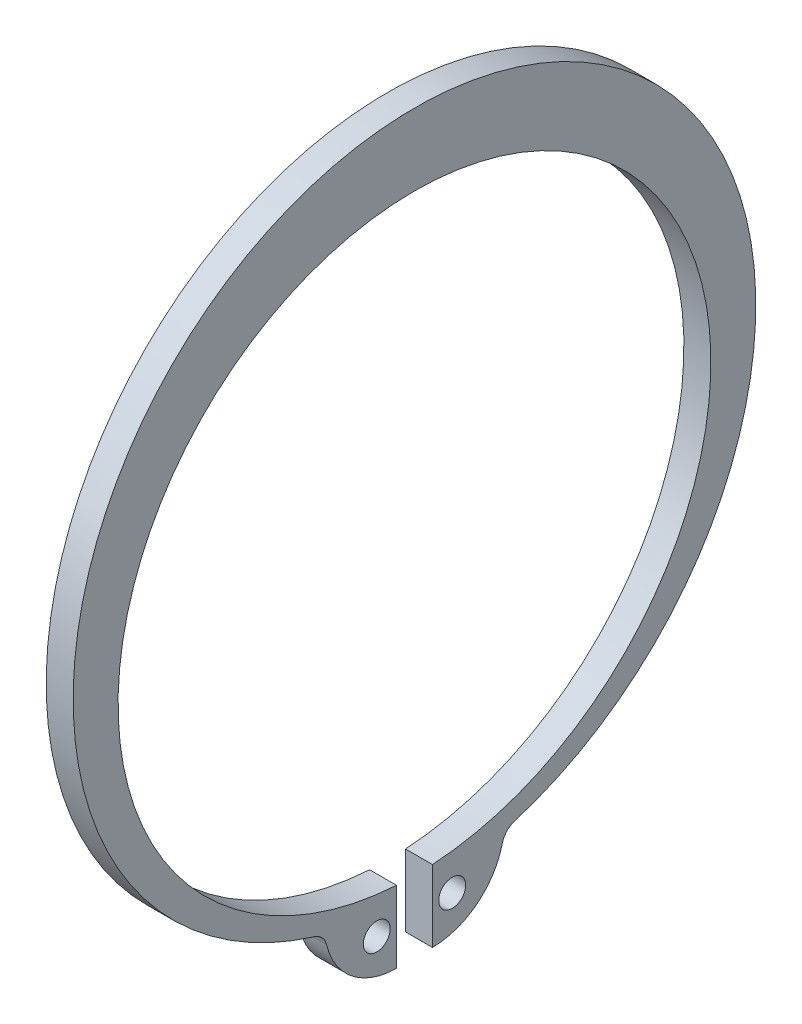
from build123d import *

# Parameters (mm, degrees)
ESQUISSE1_R          = 0.75
BASE_EXTRUSION_DEPTH = 1.5


with BuildPart() as part:
    # Esquisse1 → Base-Extrusion (new body)
    with BuildSketch(Plane(origin=(0, 0, 0), x_dir=(0, 0, -1), z_dir=(1, 0, 0))):
        with BuildLine():
            Line((-1, -16.469669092), (-1, -20.469669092))
            ThreePointArc((-1, -20.469669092), (-3.481672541, -19.606753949), (-4.892608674, -17.390319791))
            ThreePointArc((-4.892608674, -17.390319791), (-5.13590715, -16.936879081), (-5.572472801, -16.664458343))
            ThreePointArc((-5.572472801, -16.664458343), (0, 20.5), (5.572472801, -16.664458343))
            ThreePointArc((5.572472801, -16.664458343), (5.13590715, -16.936879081), (4.892608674, -17.390319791))
            ThreePointArc((4.892608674, -17.390319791), (3.481672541, -19.606753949), (1, -20.469669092))
            Line((1, -20.469669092), (1, -16.469669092))
            ThreePointArc((1, -16.469669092), (0, 16.5), (-1, -16.469669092))
        make_face()
        with Locations((-2.1, -18.384725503)):
            Circle(ESQUISSE1_R, mode=Mode.SUBTRACT)
        with Locations((2.1, -18.384725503)):
            Circle(ESQUISSE1_R, mode=Mode.SUBTRACT)
    extrude(amount=BASE_EXTRUSION_DEPTH)


solid = part.part
